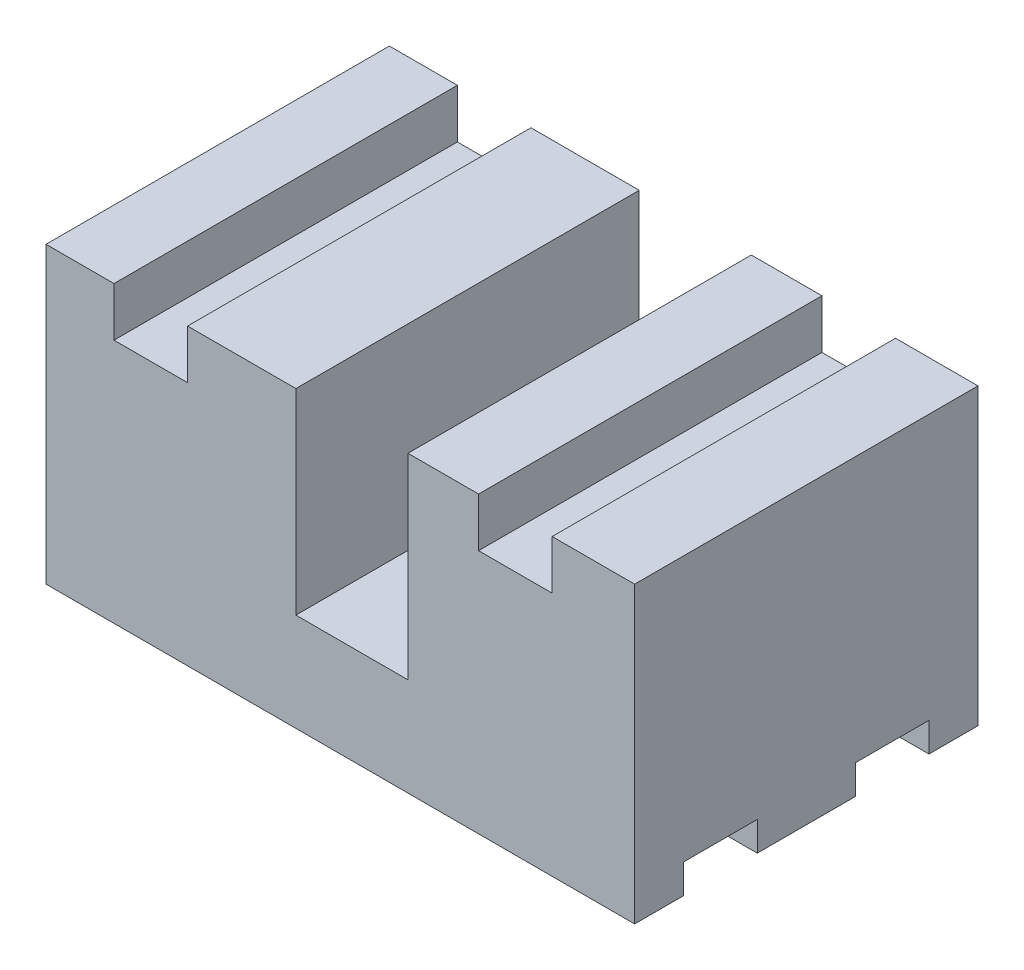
from build123d import *

# Parameters (mm, degrees)
BOSS_EXTRUDE1_DEPTH = 300
BOSS_EXTRUDE2_DEPTH = 175


with BuildPart() as part:
    # Sketch1 → Boss-Extrude1 (new body)
    with BuildSketch(Plane(origin=(0, 0, 0), x_dir=(0, 0, -1), z_dir=(1, 0, 0))):
        Polygon((0, 50), (0, 0), (25, 0), (25, 14.89943793), (62.5, 14.89943793), (62.5, 0), (112.5, 0), (112.5, 14.89943793), (150, 14.89943793), (150, 0), (175, 0), (175, 50), align=None)
    extrude(amount=BOSS_EXTRUDE1_DEPTH)

    # Sketch2 → Boss-Extrude2 (add)
    with BuildSketch(Plane.XY):
        Polygon((0, 50), (0, 150), (34.656648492, 150), (34.656648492, 125), (72.156648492, 125), (72.156648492, 150), (127.352675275, 150), (127.352675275, 50), align=None)
        Polygon((300, 50), (300, 150), (257.965859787, 150), (257.965859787, 125), (220.465859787, 125), (220.465859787, 150), (184.471740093, 150), (184.471740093, 50), align=None)
    extrude(amount=-BOSS_EXTRUDE2_DEPTH)


solid = part.part
